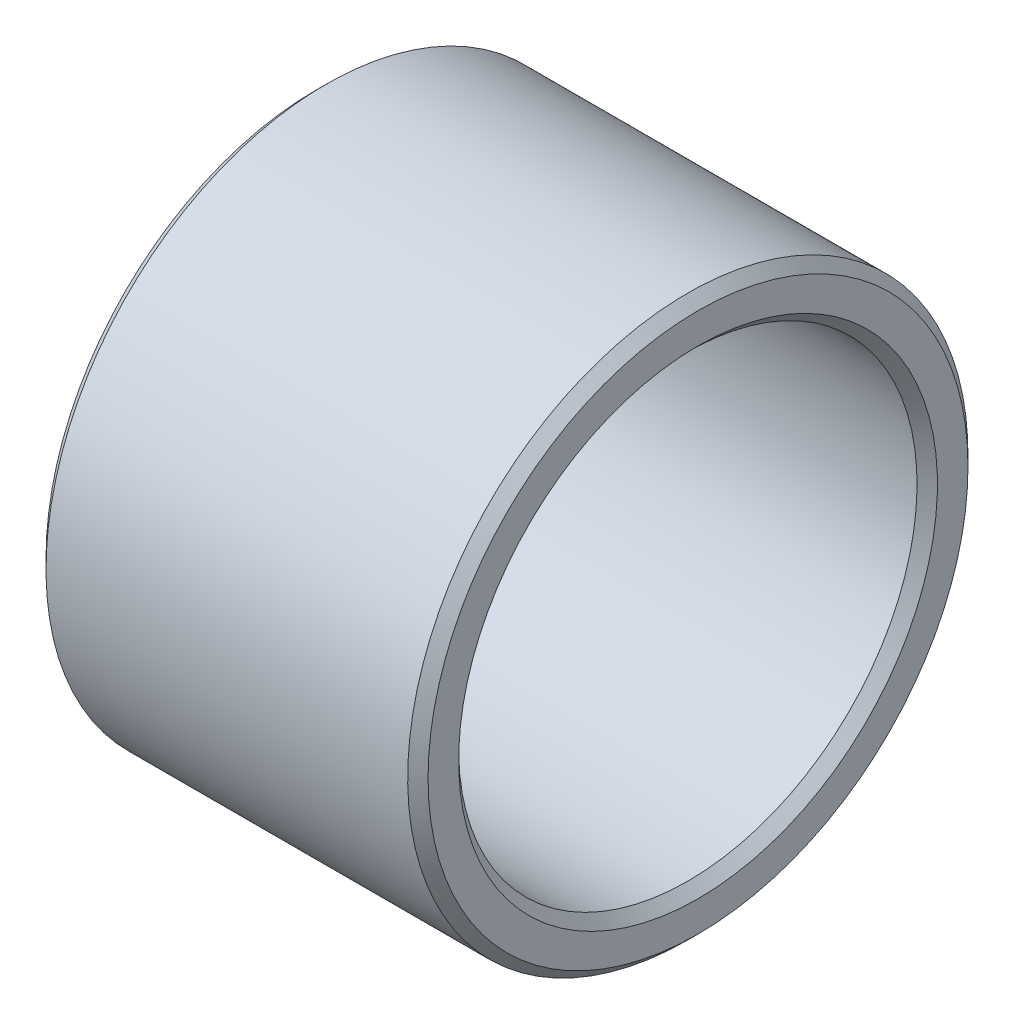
ISO-10303-21;
HEADER;
FILE_DESCRIPTION(('STEP AP214'),'2;1');
FILE_NAME('part.step','',(''),(''),'','','');
FILE_SCHEMA(('AUTOMOTIVE_DESIGN { 1 0 10303 214 1 1 1 1 }'));
ENDSEC;
DATA;
#1=APPLICATION_CONTEXT('core data for automotive mechanical design processes');
#2=APPLICATION_PROTOCOL_DEFINITION('international standard','automotive_design',2000,#1);
#3=PRODUCT_CONTEXT('',#1,'mechanical');
#4=PRODUCT('Part','Part','',(#3));
#5=PRODUCT_RELATED_PRODUCT_CATEGORY('part','',(#4));
#6=PRODUCT_DEFINITION_FORMATION('','',#4);
#7=PRODUCT_DEFINITION_CONTEXT('part definition',#1,'design');
#8=PRODUCT_DEFINITION('design','',#6,#7);
#9=PRODUCT_DEFINITION_SHAPE('','',#8);
#10=(LENGTH_UNIT() NAMED_UNIT(*) SI_UNIT(.MILLI.,.METRE.));
#11=(NAMED_UNIT(*) PLANE_ANGLE_UNIT() SI_UNIT($,.RADIAN.));
#12=(NAMED_UNIT(*) SI_UNIT($,.STERADIAN.) SOLID_ANGLE_UNIT());
#13=UNCERTAINTY_MEASURE_WITH_UNIT(LENGTH_MEASURE(1.E-05),#10,'distance_accuracy_value','');
#14=(GEOMETRIC_REPRESENTATION_CONTEXT(3) GLOBAL_UNCERTAINTY_ASSIGNED_CONTEXT((#13)) GLOBAL_UNIT_ASSIGNED_CONTEXT((#10,
#11,#12)) REPRESENTATION_CONTEXT('',''));
#15=CARTESIAN_POINT('',(0.,0.,0.));
#16=DIRECTION('',(0.,0.,1.));
#17=DIRECTION('',(1.,0.,0.));
#18=AXIS2_PLACEMENT_3D('',#15,#16,#17);
#19=CARTESIAN_POINT('',(0.,-10.,0.));
#20=DIRECTION('',(-1.,0.,0.));
#21=DIRECTION('',(0.,1.,0.));
#22=AXIS2_PLACEMENT_3D('',#19,#20,#21);
#23=PLANE('',#22);
#24=CARTESIAN_POINT('',(0.,0.,0.));
#25=DIRECTION('',(1.,0.,0.));
#26=DIRECTION('',(0.,-1.,0.));
#27=AXIS2_PLACEMENT_3D('',#24,#25,#26);
#28=CIRCLE('',#27,9.4);
#29=CARTESIAN_POINT('',(0.,-9.4,0.));
#30=VERTEX_POINT('',#29);
#31=EDGE_CURVE('E9',#30,#30,#28,.T.);
#32=ORIENTED_EDGE('',*,*,#31,.T.);
#33=EDGE_LOOP('',(#32));
#34=FACE_BOUND('',#33,.T.);
#35=CARTESIAN_POINT('',(0.,0.,0.));
#36=DIRECTION('',(1.,0.,0.));
#37=DIRECTION('',(0.,-1.,0.));
#38=AXIS2_PLACEMENT_3D('',#35,#36,#37);
#39=CIRCLE('',#38,10.6);
#40=CARTESIAN_POINT('',(0.,-10.6,0.));
#41=VERTEX_POINT('',#40);
#42=EDGE_CURVE('E62',#41,#41,#39,.T.);
#43=ORIENTED_EDGE('',*,*,#42,.F.);
#44=EDGE_LOOP('',(#43));
#45=FACE_BOUND('',#44,.T.);
#46=ADVANCED_FACE('F15',(#34,#45),#23,.T.);
#47=CARTESIAN_POINT('',(0.2,0.,0.));
#48=DIRECTION('',(-1.,0.,0.));
#49=DIRECTION('',(0.,-1.,0.));
#50=AXIS2_PLACEMENT_3D('',#47,#48,#49);
#51=CONICAL_SURFACE('',#50,9.2,0.785398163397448);
#52=CARTESIAN_POINT('',(0.4,0.,0.));
#53=DIRECTION('',(1.,0.,0.));
#54=DIRECTION('',(0.,-1.,0.));
#55=AXIS2_PLACEMENT_3D('',#52,#53,#54);
#56=CIRCLE('',#55,9.);
#57=CARTESIAN_POINT('',(0.4,-9.,0.));
#58=VERTEX_POINT('',#57);
#59=EDGE_CURVE('E19',#58,#58,#56,.T.);
#60=ORIENTED_EDGE('',*,*,#59,.T.);
#61=EDGE_LOOP('',(#60));
#62=FACE_BOUND('',#61,.T.);
#63=ORIENTED_EDGE('',*,*,#31,.F.);
#64=EDGE_LOOP('',(#63));
#65=FACE_BOUND('',#64,.T.);
#66=ADVANCED_FACE('F73',(#62,#65),#51,.F.);
#67=CARTESIAN_POINT('',(7.5,0.,0.));
#68=DIRECTION('',(-1.,0.,0.));
#69=DIRECTION('',(0.,-1.,0.));
#70=AXIS2_PLACEMENT_3D('',#67,#68,#69);
#71=CYLINDRICAL_SURFACE('',#70,9.);
#72=CARTESIAN_POINT('',(14.6,0.,0.));
#73=DIRECTION('',(1.,0.,0.));
#74=DIRECTION('',(0.,-1.,0.));
#75=AXIS2_PLACEMENT_3D('',#72,#73,#74);
#76=CIRCLE('',#75,9.);
#77=CARTESIAN_POINT('',(14.6,-9.,0.));
#78=VERTEX_POINT('',#77);
#79=EDGE_CURVE('E68',#78,#78,#76,.T.);
#80=ORIENTED_EDGE('',*,*,#79,.T.);
#81=EDGE_LOOP('',(#80));
#82=FACE_BOUND('',#81,.T.);
#83=ORIENTED_EDGE('',*,*,#59,.F.);
#84=EDGE_LOOP('',(#83));
#85=FACE_BOUND('',#84,.T.);
#86=ADVANCED_FACE('F76',(#82,#85),#71,.F.);
#87=CARTESIAN_POINT('',(14.8,0.,0.));
#88=DIRECTION('',(1.,0.,0.));
#89=DIRECTION('',(0.,-1.,0.));
#90=AXIS2_PLACEMENT_3D('',#87,#88,#89);
#91=CONICAL_SURFACE('',#90,9.2,0.785398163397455);
#92=CARTESIAN_POINT('',(15.,0.,0.));
#93=DIRECTION('',(1.,0.,0.));
#94=DIRECTION('',(0.,-1.,0.));
#95=AXIS2_PLACEMENT_3D('',#92,#93,#94);
#96=CIRCLE('',#95,9.4);
#97=CARTESIAN_POINT('',(15.,-9.4,0.));
#98=VERTEX_POINT('',#97);
#99=EDGE_CURVE('E53',#98,#98,#96,.T.);
#100=ORIENTED_EDGE('',*,*,#99,.T.);
#101=EDGE_LOOP('',(#100));
#102=FACE_BOUND('',#101,.T.);
#103=ORIENTED_EDGE('',*,*,#79,.F.);
#104=EDGE_LOOP('',(#103));
#105=FACE_BOUND('',#104,.T.);
#106=ADVANCED_FACE('F78',(#102,#105),#91,.F.);
#107=CARTESIAN_POINT('',(15.,-10.,0.));
#108=DIRECTION('',(1.,0.,0.));
#109=DIRECTION('',(0.,-1.,0.));
#110=AXIS2_PLACEMENT_3D('',#107,#108,#109);
#111=PLANE('',#110);
#112=CARTESIAN_POINT('',(15.,0.,0.));
#113=DIRECTION('',(1.,0.,0.));
#114=DIRECTION('',(0.,-1.,0.));
#115=AXIS2_PLACEMENT_3D('',#112,#113,#114);
#116=CIRCLE('',#115,10.6);
#117=CARTESIAN_POINT('',(15.,-10.6,0.));
#118=VERTEX_POINT('',#117);
#119=EDGE_CURVE('E48',#118,#118,#116,.T.);
#120=ORIENTED_EDGE('',*,*,#119,.T.);
#121=EDGE_LOOP('',(#120));
#122=FACE_BOUND('',#121,.T.);
#123=ORIENTED_EDGE('',*,*,#99,.F.);
#124=EDGE_LOOP('',(#123));
#125=FACE_BOUND('',#124,.T.);
#126=ADVANCED_FACE('F17',(#122,#125),#111,.T.);
#127=CARTESIAN_POINT('',(14.8,0.,0.));
#128=DIRECTION('',(-1.,0.,0.));
#129=DIRECTION('',(0.,-1.,0.));
#130=AXIS2_PLACEMENT_3D('',#127,#128,#129);
#131=CONICAL_SURFACE('',#130,10.8,0.785398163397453);
#132=CARTESIAN_POINT('',(14.6,0.,0.));
#133=DIRECTION('',(1.,0.,0.));
#134=DIRECTION('',(0.,-1.,0.));
#135=AXIS2_PLACEMENT_3D('',#132,#133,#134);
#136=CIRCLE('',#135,11.);
#137=CARTESIAN_POINT('',(14.6,-11.,0.));
#138=VERTEX_POINT('',#137);
#139=EDGE_CURVE('E43',#138,#138,#136,.T.);
#140=ORIENTED_EDGE('',*,*,#139,.T.);
#141=EDGE_LOOP('',(#140));
#142=FACE_BOUND('',#141,.T.);
#143=ORIENTED_EDGE('',*,*,#119,.F.);
#144=EDGE_LOOP('',(#143));
#145=FACE_BOUND('',#144,.T.);
#146=ADVANCED_FACE('F93',(#142,#145),#131,.T.);
#147=CARTESIAN_POINT('',(7.5,0.,0.));
#148=DIRECTION('',(-1.,0.,0.));
#149=DIRECTION('',(0.,-1.,0.));
#150=AXIS2_PLACEMENT_3D('',#147,#148,#149);
#151=CYLINDRICAL_SURFACE('',#150,11.);
#152=CARTESIAN_POINT('',(0.4,0.,0.));
#153=DIRECTION('',(1.,0.,0.));
#154=DIRECTION('',(0.,-1.,0.));
#155=AXIS2_PLACEMENT_3D('',#152,#153,#154);
#156=CIRCLE('',#155,11.);
#157=CARTESIAN_POINT('',(0.4,-11.,0.));
#158=VERTEX_POINT('',#157);
#159=EDGE_CURVE('E58',#158,#158,#156,.T.);
#160=ORIENTED_EDGE('',*,*,#159,.T.);
#161=EDGE_LOOP('',(#160));
#162=FACE_BOUND('',#161,.T.);
#163=ORIENTED_EDGE('',*,*,#139,.F.);
#164=EDGE_LOOP('',(#163));
#165=FACE_BOUND('',#164,.T.);
#166=ADVANCED_FACE('F59',(#162,#165),#151,.T.);
#167=CARTESIAN_POINT('',(0.2,0.,0.));
#168=DIRECTION('',(1.,0.,0.));
#169=DIRECTION('',(0.,-1.,0.));
#170=AXIS2_PLACEMENT_3D('',#167,#168,#169);
#171=CONICAL_SURFACE('',#170,10.8,0.785398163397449);
#172=ORIENTED_EDGE('',*,*,#42,.T.);
#173=EDGE_LOOP('',(#172));
#174=FACE_BOUND('',#173,.T.);
#175=ORIENTED_EDGE('',*,*,#159,.F.);
#176=EDGE_LOOP('',(#175));
#177=FACE_BOUND('',#176,.T.);
#178=ADVANCED_FACE('F96',(#174,#177),#171,.T.);
#179=CLOSED_SHELL('',(#46,#66,#86,#106,#126,#146,#166,#178));
#180=MANIFOLD_SOLID_BREP('B1',#179);
#181=ADVANCED_BREP_SHAPE_REPRESENTATION('',(#18,#180),#14);
#182=SHAPE_DEFINITION_REPRESENTATION(#9,#181);
ENDSEC;
END-ISO-10303-21;
